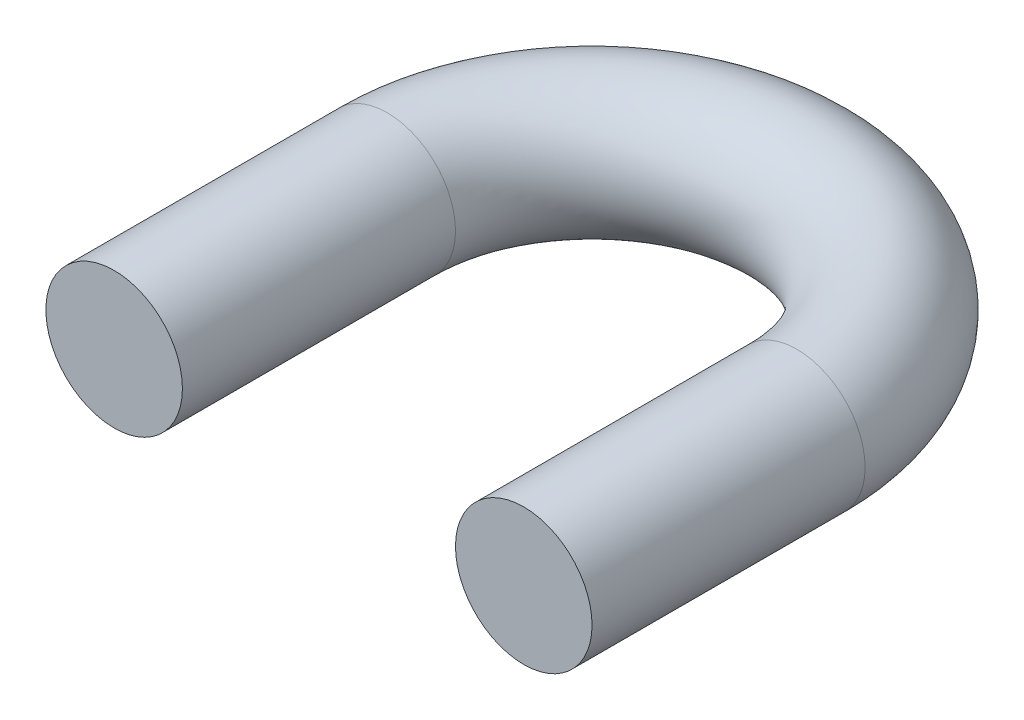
from build123d import *

# Parameters (mm, degrees)
SKETCH2_R = 2.38125


with BuildPart() as part:
    # Sweep1: sweep along a path in Sketch1
    with BuildLine(Plane(origin=(0, 0, 0), x_dir=(1, 0, 0), z_dir=(0, 1, 0))) as sweep1_path:
        Line((4.7625, -9.525), (4.7625, 0))
        ThreePointArc((4.7625, 0), (0, 4.7625), (-4.7625, 0))
        Line((-4.7625, 0), (-4.7625, -9.525))
    # Sketch2 → Sweep1 (sweep)
    with BuildSketch(Plane.XY.offset(9.525)):
        with Locations((-7.14375, 0)):
            Circle(SKETCH2_R)
    sweep(path=sweep1_path.line)


solid = part.part
